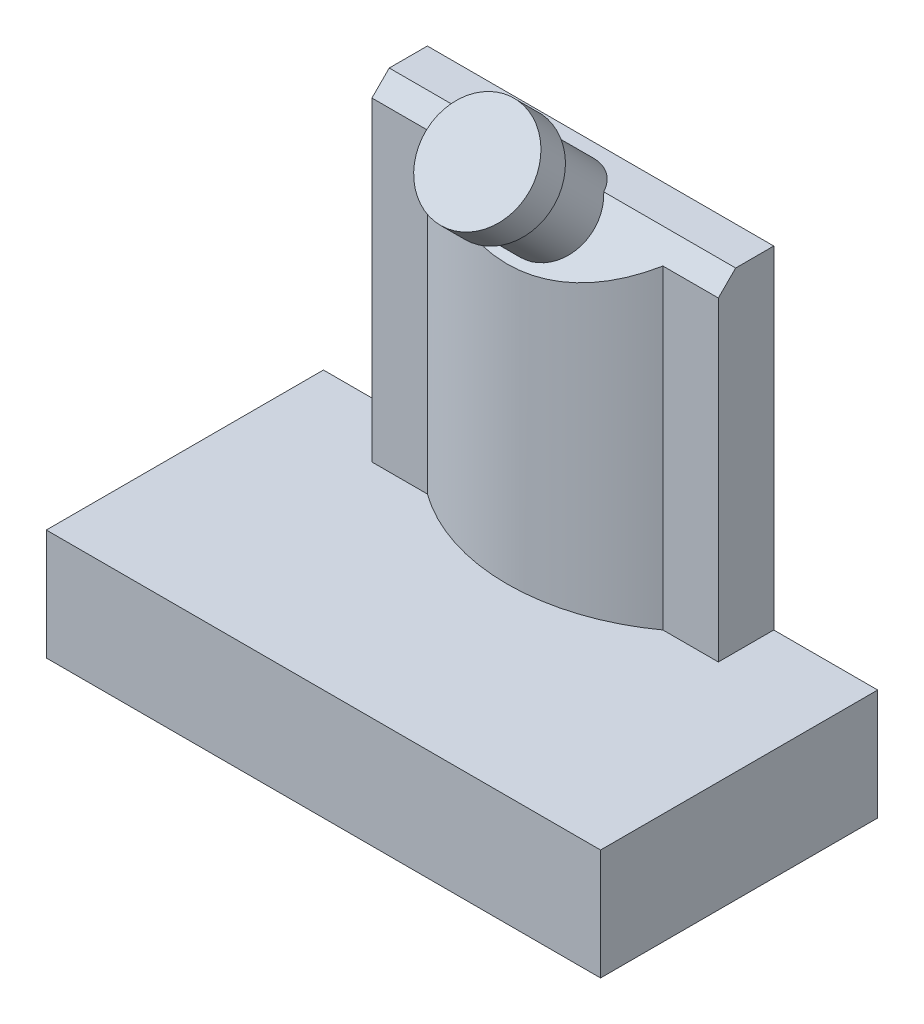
ISO-10303-21;
HEADER;
FILE_DESCRIPTION(('STEP AP214'),'2;1');
FILE_NAME('part.step','',(''),(''),'','','');
FILE_SCHEMA(('AUTOMOTIVE_DESIGN { 1 0 10303 214 1 1 1 1 }'));
ENDSEC;
DATA;
#1=APPLICATION_CONTEXT('core data for automotive mechanical design processes');
#2=APPLICATION_PROTOCOL_DEFINITION('international standard','automotive_design',2000,#1);
#3=PRODUCT_CONTEXT('',#1,'mechanical');
#4=PRODUCT('Part','Part','',(#3));
#5=PRODUCT_RELATED_PRODUCT_CATEGORY('part','',(#4));
#6=PRODUCT_DEFINITION_FORMATION('','',#4);
#7=PRODUCT_DEFINITION_CONTEXT('part definition',#1,'design');
#8=PRODUCT_DEFINITION('design','',#6,#7);
#9=PRODUCT_DEFINITION_SHAPE('','',#8);
#10=(LENGTH_UNIT() NAMED_UNIT(*) SI_UNIT(.MILLI.,.METRE.));
#11=(NAMED_UNIT(*) PLANE_ANGLE_UNIT() SI_UNIT($,.RADIAN.));
#12=(NAMED_UNIT(*) SI_UNIT($,.STERADIAN.) SOLID_ANGLE_UNIT());
#13=UNCERTAINTY_MEASURE_WITH_UNIT(LENGTH_MEASURE(1.E-05),#10,'distance_accuracy_value','');
#14=(GEOMETRIC_REPRESENTATION_CONTEXT(3) GLOBAL_UNCERTAINTY_ASSIGNED_CONTEXT((#13)) GLOBAL_UNIT_ASSIGNED_CONTEXT((#10,
#11,#12)) REPRESENTATION_CONTEXT('',''));
#15=CARTESIAN_POINT('',(0.,0.,0.));
#16=DIRECTION('',(0.,0.,1.));
#17=DIRECTION('',(1.,0.,0.));
#18=AXIS2_PLACEMENT_3D('',#15,#16,#17);
#19=CARTESIAN_POINT('',(8.2,-499982.257725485,-500000.883883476));
#20=DIRECTION('',(0.,0.707106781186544,0.707106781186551));
#21=DIRECTION('',(0.,-0.707106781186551,0.707106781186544));
#22=AXIS2_PLACEMENT_3D('',#19,#20,#21);
#23=CYLINDRICAL_SURFACE('',#22,1.24999999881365);
#24=CARTESIAN_POINT('',(8.2,12.800000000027,-5.82615798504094));
#25=DIRECTION('',(0.,1.,0.));
#26=DIRECTION('',(0.,0.,1.));
#27=AXIS2_PLACEMENT_3D('',#24,#25,#26);
#28=ELLIPSE('',#27,1.76776695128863,1.24999999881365);
#29=CARTESIAN_POINT('',(7.20705908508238,12.8,-6.90000000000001));
#30=VERTEX_POINT('',#29);
#31=CARTESIAN_POINT('',(9.19294091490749,12.8,-6.89999999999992));
#32=VERTEX_POINT('',#31);
#33=EDGE_CURVE('E42',#30,#32,#28,.F.);
#34=ORIENTED_EDGE('',*,*,#33,.F.);
#35=CARTESIAN_POINT('',(8.2,12.2630789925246,-6.36307899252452));
#36=DIRECTION('',(0.,0.707106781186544,0.707106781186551));
#37=DIRECTION('',(0.,-0.707106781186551,0.707106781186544));
#38=AXIS2_PLACEMENT_3D('',#35,#36,#37);
#39=CIRCLE('',#38,1.24999999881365);
#40=EDGE_CURVE('E138',#30,#32,#39,.T.);
#41=ORIENTED_EDGE('',*,*,#40,.T.);
#42=EDGE_LOOP('',(#34,#41));
#43=FACE_BOUND('',#42,.T.);
#44=CARTESIAN_POINT('',(8.2,13.6772925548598,-4.94886543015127));
#45=DIRECTION('',(0.,0.707106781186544,0.707106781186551));
#46=DIRECTION('',(0.,-0.707106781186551,0.707106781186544));
#47=AXIS2_PLACEMENT_3D('',#44,#45,#46);
#48=CIRCLE('',#47,1.24999999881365);
#49=CARTESIAN_POINT('',(8.2,12.7934090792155,-4.06498195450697));
#50=VERTEX_POINT('',#49);
#51=EDGE_CURVE('E30',#50,#50,#48,.F.);
#52=ORIENTED_EDGE('',*,*,#51,.T.);
#53=EDGE_LOOP('',(#52));
#54=FACE_BOUND('',#53,.T.);
#55=ADVANCED_FACE('F26',(#43,#54),#23,.T.);
#56=CARTESIAN_POINT('',(0.,3.2,-8.));
#57=DIRECTION('',(0.,-1.,0.));
#58=DIRECTION('',(0.,0.,-1.));
#59=AXIS2_PLACEMENT_3D('',#56,#57,#58);
#60=PLANE('',#59);
#61=DIRECTION('',(0.,0.,1.));
#62=VECTOR('',#61,1.);
#63=CARTESIAN_POINT('',(3.,3.2,-8.));
#64=LINE('',#63,#62);
#65=CARTESIAN_POINT('',(3.,3.2,-8.));
#66=VERTEX_POINT('',#65);
#67=CARTESIAN_POINT('',(3.,3.2,-6.4));
#68=VERTEX_POINT('',#67);
#69=EDGE_CURVE('E205',#66,#68,#64,.T.);
#70=ORIENTED_EDGE('',*,*,#69,.F.);
#71=DIRECTION('',(-1.,0.,0.));
#72=VECTOR('',#71,1.);
#73=CARTESIAN_POINT('',(0.,3.2,-8.));
#74=LINE('',#73,#72);
#75=CARTESIAN_POINT('',(0.,3.2,-8.));
#76=VERTEX_POINT('',#75);
#77=EDGE_CURVE('E250',#66,#76,#74,.T.);
#78=ORIENTED_EDGE('',*,*,#77,.T.);
#79=DIRECTION('',(0.,0.,1.));
#80=VECTOR('',#79,1.);
#81=CARTESIAN_POINT('',(0.,3.2,0.));
#82=LINE('',#81,#80);
#83=CARTESIAN_POINT('',(0.,3.2,0.));
#84=VERTEX_POINT('',#83);
#85=EDGE_CURVE('E355',#76,#84,#82,.T.);
#86=ORIENTED_EDGE('',*,*,#85,.T.);
#87=DIRECTION('',(1.,0.,0.));
#88=VECTOR('',#87,1.);
#89=CARTESIAN_POINT('',(0.,3.2,0.));
#90=LINE('',#89,#88);
#91=CARTESIAN_POINT('',(16.,3.2,0.));
#92=VERTEX_POINT('',#91);
#93=EDGE_CURVE('E357',#84,#92,#90,.T.);
#94=ORIENTED_EDGE('',*,*,#93,.T.);
#95=DIRECTION('',(0.,0.,-1.));
#96=VECTOR('',#95,1.);
#97=CARTESIAN_POINT('',(16.,3.2,0.));
#98=LINE('',#97,#96);
#99=CARTESIAN_POINT('',(16.,3.2,-8.));
#100=VERTEX_POINT('',#99);
#101=EDGE_CURVE('E255',#92,#100,#98,.T.);
#102=ORIENTED_EDGE('',*,*,#101,.T.);
#103=CARTESIAN_POINT('',(13.,3.2,-8.));
#104=VERTEX_POINT('',#103);
#105=EDGE_CURVE('E246',#100,#104,#74,.T.);
#106=ORIENTED_EDGE('',*,*,#105,.T.);
#107=DIRECTION('',(0.,0.,-1.));
#108=VECTOR('',#107,1.);
#109=CARTESIAN_POINT('',(13.,3.2,-8.));
#110=LINE('',#109,#108);
#111=CARTESIAN_POINT('',(13.,3.2,-6.4));
#112=VERTEX_POINT('',#111);
#113=EDGE_CURVE('E215',#112,#104,#110,.T.);
#114=ORIENTED_EDGE('',*,*,#113,.F.);
#115=DIRECTION('',(1.,0.,0.));
#116=VECTOR('',#115,1.);
#117=CARTESIAN_POINT('',(13.,3.2,-6.4));
#118=LINE('',#117,#116);
#119=CARTESIAN_POINT('',(11.4,3.2,-6.4));
#120=VERTEX_POINT('',#119);
#121=EDGE_CURVE('E212',#120,#112,#118,.T.);
#122=ORIENTED_EDGE('',*,*,#121,.F.);
#123=CARTESIAN_POINT('',(8.,3.2,-11.1045454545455));
#124=DIRECTION('',(0.,1.,0.));
#125=DIRECTION('',(0.,0.,1.));
#126=AXIS2_PLACEMENT_3D('',#123,#124,#125);
#127=CIRCLE('',#126,5.80454545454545);
#128=CARTESIAN_POINT('',(4.6,3.2,-6.4));
#129=VERTEX_POINT('',#128);
#130=EDGE_CURVE('E209',#129,#120,#127,.T.);
#131=ORIENTED_EDGE('',*,*,#130,.F.);
#132=DIRECTION('',(1.,0.,0.));
#133=VECTOR('',#132,1.);
#134=CARTESIAN_POINT('',(3.,3.2,-6.4));
#135=LINE('',#134,#133);
#136=EDGE_CURVE('E206',#68,#129,#135,.T.);
#137=ORIENTED_EDGE('',*,*,#136,.F.);
#138=EDGE_LOOP('',(#70,#78,#86,#94,#102,#106,#114,#122,#131,#137));
#139=FACE_BOUND('',#138,.T.);
#140=ADVANCED_FACE('F162',(#139),#60,.F.);
#141=CARTESIAN_POINT('',(1.6,2.1,-6.4));
#142=DIRECTION('',(0.,-1.,0.));
#143=DIRECTION('',(0.,0.,-1.));
#144=AXIS2_PLACEMENT_3D('',#141,#142,#143);
#145=PLANE('',#144);
#146=DIRECTION('',(0.,0.,-1.));
#147=VECTOR('',#146,1.);
#148=CARTESIAN_POINT('',(1.6,2.1,-1.6));
#149=LINE('',#148,#147);
#150=CARTESIAN_POINT('',(1.6,2.1,-1.6));
#151=VERTEX_POINT('',#150);
#152=CARTESIAN_POINT('',(1.6,2.1,-6.4));
#153=VERTEX_POINT('',#152);
#154=EDGE_CURVE('E304',#151,#153,#149,.T.);
#155=ORIENTED_EDGE('',*,*,#154,.T.);
#156=DIRECTION('',(1.,0.,0.));
#157=VECTOR('',#156,1.);
#158=CARTESIAN_POINT('',(1.6,2.1,-6.4));
#159=LINE('',#158,#157);
#160=CARTESIAN_POINT('',(14.4,2.1,-6.4));
#161=VERTEX_POINT('',#160);
#162=EDGE_CURVE('E330',#153,#161,#159,.T.);
#163=ORIENTED_EDGE('',*,*,#162,.T.);
#164=DIRECTION('',(0.,0.,1.));
#165=VECTOR('',#164,1.);
#166=CARTESIAN_POINT('',(14.4,2.1,-1.6));
#167=LINE('',#166,#165);
#168=CARTESIAN_POINT('',(14.4,2.1,-1.6));
#169=VERTEX_POINT('',#168);
#170=EDGE_CURVE('E332',#161,#169,#167,.T.);
#171=ORIENTED_EDGE('',*,*,#170,.T.);
#172=DIRECTION('',(-1.,0.,0.));
#173=VECTOR('',#172,1.);
#174=CARTESIAN_POINT('',(1.6,2.1,-1.6));
#175=LINE('',#174,#173);
#176=EDGE_CURVE('E335',#169,#151,#175,.T.);
#177=ORIENTED_EDGE('',*,*,#176,.T.);
#178=EDGE_LOOP('',(#155,#163,#171,#177));
#179=FACE_BOUND('',#178,.T.);
#180=CARTESIAN_POINT('',(8.2,2.1,-3.9));
#181=DIRECTION('',(0.,-1.,0.));
#182=DIRECTION('',(0.,0.,-1.));
#183=AXIS2_PLACEMENT_3D('',#180,#181,#182);
#184=CIRCLE('',#183,1.5);
#185=CARTESIAN_POINT('',(8.2,2.1,-5.4));
#186=VERTEX_POINT('',#185);
#187=EDGE_CURVE('E307',#186,#186,#184,.T.);
#188=ORIENTED_EDGE('',*,*,#187,.F.);
#189=EDGE_LOOP('',(#188));
#190=FACE_BOUND('',#189,.T.);
#191=ADVANCED_FACE('F166',(#179,#190),#145,.T.);
#192=CARTESIAN_POINT('',(0.,3.2,0.));
#193=DIRECTION('',(1.,0.,0.));
#194=DIRECTION('',(0.,0.,-1.));
#195=AXIS2_PLACEMENT_3D('',#192,#193,#194);
#196=PLANE('',#195);
#197=DIRECTION('',(0.,0.,1.));
#198=VECTOR('',#197,1.);
#199=CARTESIAN_POINT('',(0.,0.,0.));
#200=LINE('',#199,#198);
#201=CARTESIAN_POINT('',(0.,0.,-8.));
#202=VERTEX_POINT('',#201);
#203=CARTESIAN_POINT('',(0.,0.,0.));
#204=VERTEX_POINT('',#203);
#205=EDGE_CURVE('E340',#202,#204,#200,.T.);
#206=ORIENTED_EDGE('',*,*,#205,.T.);
#207=DIRECTION('',(0.,-1.,0.));
#208=VECTOR('',#207,1.);
#209=CARTESIAN_POINT('',(0.,3.2,0.));
#210=LINE('',#209,#208);
#211=EDGE_CURVE('E266',#84,#204,#210,.T.);
#212=ORIENTED_EDGE('',*,*,#211,.F.);
#213=ORIENTED_EDGE('',*,*,#85,.F.);
#214=DIRECTION('',(0.,-1.,0.));
#215=VECTOR('',#214,1.);
#216=CARTESIAN_POINT('',(0.,3.2,-8.));
#217=LINE('',#216,#215);
#218=EDGE_CURVE('E249',#76,#202,#217,.T.);
#219=ORIENTED_EDGE('',*,*,#218,.T.);
#220=EDGE_LOOP('',(#206,#212,#213,#219));
#221=FACE_BOUND('',#220,.T.);
#222=ADVANCED_FACE('F28',(#221),#196,.F.);
#223=CARTESIAN_POINT('',(0.,3.2,0.));
#224=DIRECTION('',(0.,0.,-1.));
#225=DIRECTION('',(-1.,0.,0.));
#226=AXIS2_PLACEMENT_3D('',#223,#224,#225);
#227=PLANE('',#226);
#228=DIRECTION('',(1.,0.,0.));
#229=VECTOR('',#228,1.);
#230=CARTESIAN_POINT('',(0.,0.,0.));
#231=LINE('',#230,#229);
#232=CARTESIAN_POINT('',(16.,0.,0.));
#233=VERTEX_POINT('',#232);
#234=EDGE_CURVE('E349',#204,#233,#231,.T.);
#235=ORIENTED_EDGE('',*,*,#234,.T.);
#236=DIRECTION('',(0.,-1.,0.));
#237=VECTOR('',#236,1.);
#238=CARTESIAN_POINT('',(16.,3.2,0.));
#239=LINE('',#238,#237);
#240=EDGE_CURVE('E263',#92,#233,#239,.T.);
#241=ORIENTED_EDGE('',*,*,#240,.F.);
#242=ORIENTED_EDGE('',*,*,#93,.F.);
#243=ORIENTED_EDGE('',*,*,#211,.T.);
#244=EDGE_LOOP('',(#235,#241,#242,#243));
#245=FACE_BOUND('',#244,.T.);
#246=ADVANCED_FACE('F297',(#245),#227,.F.);
#247=CARTESIAN_POINT('',(16.,3.2,0.));
#248=DIRECTION('',(-1.,0.,0.));
#249=DIRECTION('',(0.,0.,1.));
#250=AXIS2_PLACEMENT_3D('',#247,#248,#249);
#251=PLANE('',#250);
#252=DIRECTION('',(0.,0.,-1.));
#253=VECTOR('',#252,1.);
#254=CARTESIAN_POINT('',(16.,0.,0.));
#255=LINE('',#254,#253);
#256=CARTESIAN_POINT('',(16.,0.,-8.));
#257=VERTEX_POINT('',#256);
#258=EDGE_CURVE('E351',#233,#257,#255,.T.);
#259=ORIENTED_EDGE('',*,*,#258,.T.);
#260=DIRECTION('',(0.,-1.,0.));
#261=VECTOR('',#260,1.);
#262=CARTESIAN_POINT('',(16.,3.2,-8.));
#263=LINE('',#262,#261);
#264=EDGE_CURVE('E260',#100,#257,#263,.T.);
#265=ORIENTED_EDGE('',*,*,#264,.F.);
#266=ORIENTED_EDGE('',*,*,#101,.F.);
#267=ORIENTED_EDGE('',*,*,#240,.T.);
#268=EDGE_LOOP('',(#259,#265,#266,#267));
#269=FACE_BOUND('',#268,.T.);
#270=ADVANCED_FACE('F376',(#269),#251,.F.);
#271=CARTESIAN_POINT('',(0.,3.2,-8.));
#272=DIRECTION('',(0.,0.,1.));
#273=DIRECTION('',(1.,0.,0.));
#274=AXIS2_PLACEMENT_3D('',#271,#272,#273);
#275=PLANE('',#274);
#276=DIRECTION('',(-1.,0.,0.));
#277=VECTOR('',#276,1.);
#278=CARTESIAN_POINT('',(0.,0.,-8.));
#279=LINE('',#278,#277);
#280=EDGE_CURVE('E353',#257,#202,#279,.T.);
#281=ORIENTED_EDGE('',*,*,#280,.T.);
#282=ORIENTED_EDGE('',*,*,#218,.F.);
#283=ORIENTED_EDGE('',*,*,#77,.F.);
#284=DIRECTION('',(0.,-1.,0.));
#285=VECTOR('',#284,1.);
#286=CARTESIAN_POINT('',(3.,12.8,-8.));
#287=LINE('',#286,#285);
#288=CARTESIAN_POINT('',(3.,12.8,-8.));
#289=VERTEX_POINT('',#288);
#290=EDGE_CURVE('E230',#289,#66,#287,.T.);
#291=ORIENTED_EDGE('',*,*,#290,.F.);
#292=DIRECTION('',(-1.,0.,0.));
#293=VECTOR('',#292,1.);
#294=CARTESIAN_POINT('',(3.,12.8,-8.));
#295=LINE('',#294,#293);
#296=CARTESIAN_POINT('',(13.,12.8,-8.));
#297=VERTEX_POINT('',#296);
#298=EDGE_CURVE('E389',#297,#289,#295,.T.);
#299=ORIENTED_EDGE('',*,*,#298,.F.);
#300=DIRECTION('',(0.,-1.,0.));
#301=VECTOR('',#300,1.);
#302=CARTESIAN_POINT('',(13.,12.8,-8.));
#303=LINE('',#302,#301);
#304=EDGE_CURVE('E226',#297,#104,#303,.T.);
#305=ORIENTED_EDGE('',*,*,#304,.T.);
#306=ORIENTED_EDGE('',*,*,#105,.F.);
#307=ORIENTED_EDGE('',*,*,#264,.T.);
#308=EDGE_LOOP('',(#281,#282,#283,#291,#299,#305,#306,#307));
#309=FACE_BOUND('',#308,.T.);
#310=ADVANCED_FACE('F370',(#309),#275,.F.);
#311=CARTESIAN_POINT('',(0.,0.,-8.));
#312=DIRECTION('',(0.,-1.,0.));
#313=DIRECTION('',(0.,0.,-1.));
#314=AXIS2_PLACEMENT_3D('',#311,#312,#313);
#315=PLANE('',#314);
#316=DIRECTION('',(0.,0.,-1.));
#317=VECTOR('',#316,1.);
#318=CARTESIAN_POINT('',(1.6,0.,-1.6));
#319=LINE('',#318,#317);
#320=CARTESIAN_POINT('',(1.6,0.,-1.6));
#321=VERTEX_POINT('',#320);
#322=CARTESIAN_POINT('',(1.6,0.,-6.4));
#323=VERTEX_POINT('',#322);
#324=EDGE_CURVE('E313',#321,#323,#319,.T.);
#325=ORIENTED_EDGE('',*,*,#324,.F.);
#326=DIRECTION('',(-1.,0.,0.));
#327=VECTOR('',#326,1.);
#328=CARTESIAN_POINT('',(1.6,0.,-1.6));
#329=LINE('',#328,#327);
#330=CARTESIAN_POINT('',(14.4,0.,-1.6));
#331=VERTEX_POINT('',#330);
#332=EDGE_CURVE('E326',#331,#321,#329,.T.);
#333=ORIENTED_EDGE('',*,*,#332,.F.);
#334=DIRECTION('',(0.,0.,1.));
#335=VECTOR('',#334,1.);
#336=CARTESIAN_POINT('',(14.4,0.,-1.6));
#337=LINE('',#336,#335);
#338=CARTESIAN_POINT('',(14.4,0.,-6.4));
#339=VERTEX_POINT('',#338);
#340=EDGE_CURVE('E323',#339,#331,#337,.T.);
#341=ORIENTED_EDGE('',*,*,#340,.F.);
#342=DIRECTION('',(1.,0.,0.));
#343=VECTOR('',#342,1.);
#344=CARTESIAN_POINT('',(1.6,0.,-6.4));
#345=LINE('',#344,#343);
#346=EDGE_CURVE('E320',#323,#339,#345,.T.);
#347=ORIENTED_EDGE('',*,*,#346,.F.);
#348=EDGE_LOOP('',(#325,#333,#341,#347));
#349=FACE_BOUND('',#348,.T.);
#350=ORIENTED_EDGE('',*,*,#205,.F.);
#351=ORIENTED_EDGE('',*,*,#280,.F.);
#352=ORIENTED_EDGE('',*,*,#258,.F.);
#353=ORIENTED_EDGE('',*,*,#234,.F.);
#354=EDGE_LOOP('',(#350,#351,#352,#353));
#355=FACE_BOUND('',#354,.T.);
#356=ADVANCED_FACE('F448',(#349,#355),#315,.T.);
#357=CARTESIAN_POINT('',(1.6,2.1,-1.6));
#358=DIRECTION('',(-1.,0.,0.));
#359=DIRECTION('',(0.,0.,1.));
#360=AXIS2_PLACEMENT_3D('',#357,#358,#359);
#361=PLANE('',#360);
#362=ORIENTED_EDGE('',*,*,#324,.T.);
#363=DIRECTION('',(0.,-1.,0.));
#364=VECTOR('',#363,1.);
#365=CARTESIAN_POINT('',(1.6,2.1,-6.4));
#366=LINE('',#365,#364);
#367=EDGE_CURVE('E337',#153,#323,#366,.T.);
#368=ORIENTED_EDGE('',*,*,#367,.F.);
#369=ORIENTED_EDGE('',*,*,#154,.F.);
#370=DIRECTION('',(0.,-1.,0.));
#371=VECTOR('',#370,1.);
#372=CARTESIAN_POINT('',(1.6,2.1,-1.6));
#373=LINE('',#372,#371);
#374=EDGE_CURVE('E338',#151,#321,#373,.T.);
#375=ORIENTED_EDGE('',*,*,#374,.T.);
#376=EDGE_LOOP('',(#362,#368,#369,#375));
#377=FACE_BOUND('',#376,.T.);
#378=ADVANCED_FACE('F501',(#377),#361,.F.);
#379=CARTESIAN_POINT('',(1.6,2.1,-1.6));
#380=DIRECTION('',(0.,0.,1.));
#381=DIRECTION('',(1.,0.,0.));
#382=AXIS2_PLACEMENT_3D('',#379,#380,#381);
#383=PLANE('',#382);
#384=ORIENTED_EDGE('',*,*,#332,.T.);
#385=ORIENTED_EDGE('',*,*,#374,.F.);
#386=ORIENTED_EDGE('',*,*,#176,.F.);
#387=DIRECTION('',(0.,-1.,0.));
#388=VECTOR('',#387,1.);
#389=CARTESIAN_POINT('',(14.4,2.1,-1.6));
#390=LINE('',#389,#388);
#391=EDGE_CURVE('E341',#169,#331,#390,.T.);
#392=ORIENTED_EDGE('',*,*,#391,.T.);
#393=EDGE_LOOP('',(#384,#385,#386,#392));
#394=FACE_BOUND('',#393,.T.);
#395=ADVANCED_FACE('F509',(#394),#383,.F.);
#396=CARTESIAN_POINT('',(14.4,2.1,-1.6));
#397=DIRECTION('',(1.,0.,0.));
#398=DIRECTION('',(0.,0.,-1.));
#399=AXIS2_PLACEMENT_3D('',#396,#397,#398);
#400=PLANE('',#399);
#401=ORIENTED_EDGE('',*,*,#340,.T.);
#402=ORIENTED_EDGE('',*,*,#391,.F.);
#403=ORIENTED_EDGE('',*,*,#170,.F.);
#404=DIRECTION('',(0.,-1.,0.));
#405=VECTOR('',#404,1.);
#406=CARTESIAN_POINT('',(14.4,2.1,-6.4));
#407=LINE('',#406,#405);
#408=EDGE_CURVE('E343',#161,#339,#407,.T.);
#409=ORIENTED_EDGE('',*,*,#408,.T.);
#410=EDGE_LOOP('',(#401,#402,#403,#409));
#411=FACE_BOUND('',#410,.T.);
#412=ADVANCED_FACE('F517',(#411),#400,.F.);
#413=CARTESIAN_POINT('',(1.6,2.1,-6.4));
#414=DIRECTION('',(0.,0.,-1.));
#415=DIRECTION('',(-1.,0.,0.));
#416=AXIS2_PLACEMENT_3D('',#413,#414,#415);
#417=PLANE('',#416);
#418=ORIENTED_EDGE('',*,*,#346,.T.);
#419=ORIENTED_EDGE('',*,*,#408,.F.);
#420=ORIENTED_EDGE('',*,*,#162,.F.);
#421=ORIENTED_EDGE('',*,*,#367,.T.);
#422=EDGE_LOOP('',(#418,#419,#420,#421));
#423=FACE_BOUND('',#422,.T.);
#424=ADVANCED_FACE('F419',(#423),#417,.F.);
#425=CARTESIAN_POINT('',(8.2,0.1,-3.9));
#426=DIRECTION('',(0.,-1.,0.));
#427=DIRECTION('',(0.,0.,-1.));
#428=AXIS2_PLACEMENT_3D('',#425,#426,#427);
#429=PLANE('',#428);
#430=CARTESIAN_POINT('',(8.2,0.1,-3.9));
#431=DIRECTION('',(0.,-1.,0.));
#432=DIRECTION('',(0.,0.,-1.));
#433=AXIS2_PLACEMENT_3D('',#430,#431,#432);
#434=CIRCLE('',#433,0.900000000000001);
#435=CARTESIAN_POINT('',(8.2,0.1,-4.8));
#436=VERTEX_POINT('',#435);
#437=EDGE_CURVE('E235',#436,#436,#434,.F.);
#438=ORIENTED_EDGE('',*,*,#437,.T.);
#439=EDGE_LOOP('',(#438));
#440=FACE_BOUND('',#439,.T.);
#441=CARTESIAN_POINT('',(8.2,0.1,-3.9));
#442=DIRECTION('',(0.,-1.,0.));
#443=DIRECTION('',(0.,0.,-1.));
#444=AXIS2_PLACEMENT_3D('',#441,#442,#443);
#445=CIRCLE('',#444,1.5);
#446=CARTESIAN_POINT('',(8.2,0.1,-5.4));
#447=VERTEX_POINT('',#446);
#448=EDGE_CURVE('E309',#447,#447,#445,.T.);
#449=ORIENTED_EDGE('',*,*,#448,.T.);
#450=EDGE_LOOP('',(#449));
#451=FACE_BOUND('',#450,.T.);
#452=ADVANCED_FACE('F418',(#440,#451),#429,.T.);
#453=CARTESIAN_POINT('',(8.2,0.1,-3.9));
#454=DIRECTION('',(0.,1.,0.));
#455=DIRECTION('',(0.,0.,1.));
#456=AXIS2_PLACEMENT_3D('',#453,#454,#455);
#457=CYLINDRICAL_SURFACE('',#456,1.5);
#458=ORIENTED_EDGE('',*,*,#448,.F.);
#459=EDGE_LOOP('',(#458));
#460=FACE_BOUND('',#459,.T.);
#461=ORIENTED_EDGE('',*,*,#187,.T.);
#462=EDGE_LOOP('',(#461));
#463=FACE_BOUND('',#462,.T.);
#464=ADVANCED_FACE('F286',(#460,#463),#457,.T.);
#465=CARTESIAN_POINT('',(8.2,0.1,-3.9));
#466=DIRECTION('',(0.,1.,0.));
#467=DIRECTION('',(0.,0.,1.));
#468=AXIS2_PLACEMENT_3D('',#465,#466,#467);
#469=CYLINDRICAL_SURFACE('',#468,0.800000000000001);
#470=CARTESIAN_POINT('',(8.2,0.2,-3.9));
#471=DIRECTION('',(0.,-1.,0.));
#472=DIRECTION('',(0.,0.,-1.));
#473=AXIS2_PLACEMENT_3D('',#470,#471,#472);
#474=CIRCLE('',#473,0.800000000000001);
#475=CARTESIAN_POINT('',(8.2,0.2,-4.7));
#476=VERTEX_POINT('',#475);
#477=EDGE_CURVE('E237',#476,#476,#474,.T.);
#478=ORIENTED_EDGE('',*,*,#477,.T.);
#479=EDGE_LOOP('',(#478));
#480=FACE_BOUND('',#479,.T.);
#481=CARTESIAN_POINT('',(8.2,2.1,-3.9));
#482=DIRECTION('',(0.,-1.,0.));
#483=DIRECTION('',(0.,0.,-1.));
#484=AXIS2_PLACEMENT_3D('',#481,#482,#483);
#485=CIRCLE('',#484,0.800000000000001);
#486=CARTESIAN_POINT('',(8.2,2.1,-4.7));
#487=VERTEX_POINT('',#486);
#488=EDGE_CURVE('E242',#487,#487,#485,.F.);
#489=ORIENTED_EDGE('',*,*,#488,.T.);
#490=EDGE_LOOP('',(#489));
#491=FACE_BOUND('',#490,.T.);
#492=ADVANCED_FACE('F271',(#480,#491),#469,.F.);
#493=ORIENTED_EDGE('',*,*,#488,.F.);
#494=EDGE_LOOP('',(#493));
#495=FACE_BOUND('',#494,.T.);
#496=ADVANCED_FACE('F273',(#495),#145,.T.);
#497=CARTESIAN_POINT('',(8.2,0.2,-3.9));
#498=DIRECTION('',(0.,-1.,0.));
#499=DIRECTION('',(0.,0.,-1.));
#500=AXIS2_PLACEMENT_3D('',#497,#498,#499);
#501=TOROIDAL_SURFACE('',#500,0.900000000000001,0.1);
#502=ORIENTED_EDGE('',*,*,#437,.F.);
#503=EDGE_LOOP('',(#502));
#504=FACE_BOUND('',#503,.T.);
#505=ORIENTED_EDGE('',*,*,#477,.F.);
#506=EDGE_LOOP('',(#505));
#507=FACE_BOUND('',#506,.T.);
#508=ADVANCED_FACE('F275',(#504,#507),#501,.T.);
#509=CARTESIAN_POINT('',(3.,12.8,-8.));
#510=DIRECTION('',(1.,0.,0.));
#511=DIRECTION('',(0.,0.,-1.));
#512=AXIS2_PLACEMENT_3D('',#509,#510,#511);
#513=PLANE('',#512);
#514=DIRECTION('',(0.,-1.,0.));
#515=VECTOR('',#514,1.);
#516=CARTESIAN_POINT('',(3.,12.8,-6.4));
#517=LINE('',#516,#515);
#518=CARTESIAN_POINT('',(3.,12.3,-6.4));
#519=VERTEX_POINT('',#518);
#520=EDGE_CURVE('E310',#519,#68,#517,.T.);
#521=ORIENTED_EDGE('',*,*,#520,.F.);
#522=DIRECTION('',(0.,0.707106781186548,-0.707106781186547));
#523=VECTOR('',#522,1.);
#524=CARTESIAN_POINT('',(3.,13.35,-7.45000000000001));
#525=LINE('',#524,#523);
#526=CARTESIAN_POINT('',(3.,12.8,-6.90000000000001));
#527=VERTEX_POINT('',#526);
#528=EDGE_CURVE('E202',#519,#527,#525,.T.);
#529=ORIENTED_EDGE('',*,*,#528,.T.);
#530=DIRECTION('',(0.,0.,1.));
#531=VECTOR('',#530,1.);
#532=CARTESIAN_POINT('',(3.,12.8,-8.));
#533=LINE('',#532,#531);
#534=EDGE_CURVE('E218',#289,#527,#533,.T.);
#535=ORIENTED_EDGE('',*,*,#534,.F.);
#536=ORIENTED_EDGE('',*,*,#290,.T.);
#537=ORIENTED_EDGE('',*,*,#69,.T.);
#538=EDGE_LOOP('',(#521,#529,#535,#536,#537));
#539=FACE_BOUND('',#538,.T.);
#540=ADVANCED_FACE('F282',(#539),#513,.F.);
#541=CARTESIAN_POINT('',(3.,12.8,-6.4));
#542=DIRECTION('',(0.,0.,-1.));
#543=DIRECTION('',(-1.,0.,0.));
#544=AXIS2_PLACEMENT_3D('',#541,#542,#543);
#545=PLANE('',#544);
#546=DIRECTION('',(0.,-1.,0.));
#547=VECTOR('',#546,1.);
#548=CARTESIAN_POINT('',(4.6,12.8,-6.4));
#549=LINE('',#548,#547);
#550=CARTESIAN_POINT('',(4.6,12.3,-6.4));
#551=VERTEX_POINT('',#550);
#552=EDGE_CURVE('E315',#551,#129,#549,.T.);
#553=ORIENTED_EDGE('',*,*,#552,.F.);
#554=DIRECTION('',(-1.,0.,0.));
#555=VECTOR('',#554,1.);
#556=CARTESIAN_POINT('',(3.,12.3,-6.4));
#557=LINE('',#556,#555);
#558=EDGE_CURVE('E199',#551,#519,#557,.T.);
#559=ORIENTED_EDGE('',*,*,#558,.T.);
#560=ORIENTED_EDGE('',*,*,#520,.T.);
#561=ORIENTED_EDGE('',*,*,#136,.T.);
#562=EDGE_LOOP('',(#553,#559,#560,#561));
#563=FACE_BOUND('',#562,.T.);
#564=ADVANCED_FACE('F397',(#563),#545,.F.);
#565=CARTESIAN_POINT('',(8.,12.8,-11.1045454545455));
#566=DIRECTION('',(0.,-1.,0.));
#567=DIRECTION('',(0.,0.,-1.));
#568=AXIS2_PLACEMENT_3D('',#565,#566,#567);
#569=CYLINDRICAL_SURFACE('',#568,5.80454545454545);
#570=CARTESIAN_POINT('',(8.,17.0045454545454,-11.1045454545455));
#571=DIRECTION('',(0.,-0.707106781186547,-0.707106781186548));
#572=DIRECTION('',(0.,-0.707106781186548,0.707106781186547));
#573=AXIS2_PLACEMENT_3D('',#570,#571,#572);
#574=ELLIPSE('',#573,8.20886690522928,5.80454545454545);
#575=CARTESIAN_POINT('',(11.4,12.3,-6.4));
#576=VERTEX_POINT('',#575);
#577=EDGE_CURVE('E197',#576,#551,#574,.T.);
#578=ORIENTED_EDGE('',*,*,#577,.T.);
#579=ORIENTED_EDGE('',*,*,#552,.T.);
#580=ORIENTED_EDGE('',*,*,#130,.T.);
#581=DIRECTION('',(0.,-1.,0.));
#582=VECTOR('',#581,1.);
#583=CARTESIAN_POINT('',(11.4,12.8,-6.4));
#584=LINE('',#583,#582);
#585=EDGE_CURVE('E385',#576,#120,#584,.T.);
#586=ORIENTED_EDGE('',*,*,#585,.F.);
#587=EDGE_LOOP('',(#578,#579,#580,#586));
#588=FACE_BOUND('',#587,.T.);
#589=ADVANCED_FACE('F393',(#588),#569,.T.);
#590=CARTESIAN_POINT('',(13.,12.8,-6.4));
#591=DIRECTION('',(0.,0.,-1.));
#592=DIRECTION('',(-1.,0.,0.));
#593=AXIS2_PLACEMENT_3D('',#590,#591,#592);
#594=PLANE('',#593);
#595=DIRECTION('',(0.,-1.,0.));
#596=VECTOR('',#595,1.);
#597=CARTESIAN_POINT('',(13.,12.8,-6.4));
#598=LINE('',#597,#596);
#599=CARTESIAN_POINT('',(13.,12.3,-6.4));
#600=VERTEX_POINT('',#599);
#601=EDGE_CURVE('E229',#600,#112,#598,.T.);
#602=ORIENTED_EDGE('',*,*,#601,.F.);
#603=DIRECTION('',(-1.,0.,0.));
#604=VECTOR('',#603,1.);
#605=CARTESIAN_POINT('',(13.,12.3,-6.4));
#606=LINE('',#605,#604);
#607=EDGE_CURVE('E194',#600,#576,#606,.T.);
#608=ORIENTED_EDGE('',*,*,#607,.T.);
#609=ORIENTED_EDGE('',*,*,#585,.T.);
#610=ORIENTED_EDGE('',*,*,#121,.T.);
#611=EDGE_LOOP('',(#602,#608,#609,#610));
#612=FACE_BOUND('',#611,.T.);
#613=ADVANCED_FACE('F404',(#612),#594,.F.);
#614=CARTESIAN_POINT('',(13.,12.8,-8.));
#615=DIRECTION('',(-1.,0.,0.));
#616=DIRECTION('',(0.,0.,1.));
#617=AXIS2_PLACEMENT_3D('',#614,#615,#616);
#618=PLANE('',#617);
#619=DIRECTION('',(0.,0.,-1.));
#620=VECTOR('',#619,1.);
#621=CARTESIAN_POINT('',(13.,12.8,-8.));
#622=LINE('',#621,#620);
#623=CARTESIAN_POINT('',(13.,12.8,-6.90000000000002));
#624=VERTEX_POINT('',#623);
#625=EDGE_CURVE('E403',#624,#297,#622,.T.);
#626=ORIENTED_EDGE('',*,*,#625,.F.);
#627=DIRECTION('',(0.,0.707106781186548,-0.707106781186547));
#628=VECTOR('',#627,1.);
#629=CARTESIAN_POINT('',(13.,12.8,-6.90000000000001));
#630=LINE('',#629,#628);
#631=EDGE_CURVE('E49',#600,#624,#630,.T.);
#632=ORIENTED_EDGE('',*,*,#631,.F.);
#633=ORIENTED_EDGE('',*,*,#601,.T.);
#634=ORIENTED_EDGE('',*,*,#113,.T.);
#635=ORIENTED_EDGE('',*,*,#304,.F.);
#636=EDGE_LOOP('',(#626,#632,#633,#634,#635));
#637=FACE_BOUND('',#636,.T.);
#638=ADVANCED_FACE('F159',(#637),#618,.F.);
#639=CARTESIAN_POINT('',(8.,12.8,-11.1045454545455));
#640=DIRECTION('',(0.,1.,0.));
#641=DIRECTION('',(0.,0.,1.));
#642=AXIS2_PLACEMENT_3D('',#639,#640,#641);
#643=PLANE('',#642);
#644=ORIENTED_EDGE('',*,*,#33,.T.);
#645=DIRECTION('',(-1.,0.,0.));
#646=VECTOR('',#645,1.);
#647=CARTESIAN_POINT('',(8.,12.8,-6.90000000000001));
#648=LINE('',#647,#646);
#649=EDGE_CURVE('E11',#624,#32,#648,.T.);
#650=ORIENTED_EDGE('',*,*,#649,.F.);
#651=ORIENTED_EDGE('',*,*,#625,.T.);
#652=ORIENTED_EDGE('',*,*,#298,.T.);
#653=ORIENTED_EDGE('',*,*,#534,.T.);
#654=EDGE_CURVE('E35',#30,#527,#648,.T.);
#655=ORIENTED_EDGE('',*,*,#654,.F.);
#656=EDGE_LOOP('',(#644,#650,#651,#652,#653,#655));
#657=FACE_BOUND('',#656,.T.);
#658=ADVANCED_FACE('F143',(#657),#643,.T.);
#659=CARTESIAN_POINT('',(-2.50000000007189E-05,12.8,-6.90000000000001));
#660=DIRECTION('',(0.,-0.707106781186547,-0.707106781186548));
#661=DIRECTION('',(0.,0.707106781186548,-0.707106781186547));
#662=AXIS2_PLACEMENT_3D('',#659,#660,#661);
#663=PLANE('',#662);
#664=ORIENTED_EDGE('',*,*,#649,.T.);
#665=ORIENTED_EDGE('',*,*,#40,.F.);
#666=ORIENTED_EDGE('',*,*,#654,.T.);
#667=ORIENTED_EDGE('',*,*,#528,.F.);
#668=ORIENTED_EDGE('',*,*,#558,.F.);
#669=ORIENTED_EDGE('',*,*,#577,.F.);
#670=ORIENTED_EDGE('',*,*,#607,.F.);
#671=ORIENTED_EDGE('',*,*,#631,.T.);
#672=EDGE_LOOP('',(#664,#665,#666,#667,#668,#669,#670,#671));
#673=FACE_BOUND('',#672,.T.);
#674=ADVANCED_FACE('F147',(#673),#663,.F.);
#675=CARTESIAN_POINT('',(8.2,13.6772925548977,-4.94886543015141));
#676=DIRECTION('',(0.,0.707106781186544,0.707106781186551));
#677=DIRECTION('',(0.,-0.707106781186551,0.707106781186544));
#678=AXIS2_PLACEMENT_3D('',#675,#676,#677);
#679=CYLINDRICAL_SURFACE('',#678,1.49999999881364);
#680=CARTESIAN_POINT('',(8.2,13.6772925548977,-4.94886543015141));
#681=DIRECTION('',(0.,0.707106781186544,0.707106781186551));
#682=DIRECTION('',(0.,-0.707106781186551,0.707106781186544));
#683=AXIS2_PLACEMENT_3D('',#680,#681,#682);
#684=CIRCLE('',#683,1.49999999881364);
#685=CARTESIAN_POINT('',(8.2,12.6166323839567,-3.88820525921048));
#686=VERTEX_POINT('',#685);
#687=EDGE_CURVE('E183',#686,#686,#684,.T.);
#688=ORIENTED_EDGE('',*,*,#687,.T.);
#689=EDGE_LOOP('',(#688));
#690=FACE_BOUND('',#689,.T.);
#691=CARTESIAN_POINT('',(8.2,14.3843993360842,-4.24175864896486));
#692=DIRECTION('',(0.,0.707106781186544,0.707106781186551));
#693=DIRECTION('',(0.,-0.707106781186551,0.707106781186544));
#694=AXIS2_PLACEMENT_3D('',#691,#692,#693);
#695=CIRCLE('',#694,1.49999999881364);
#696=CARTESIAN_POINT('',(8.2,13.3237391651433,-3.18109847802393));
#697=VERTEX_POINT('',#696);
#698=EDGE_CURVE('E184',#697,#697,#695,.T.);
#699=ORIENTED_EDGE('',*,*,#698,.F.);
#700=EDGE_LOOP('',(#699));
#701=FACE_BOUND('',#700,.T.);
#702=ADVANCED_FACE('F149',(#690,#701),#679,.T.);
#703=CARTESIAN_POINT('',(8.2,13.6772925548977,-4.94886543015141));
#704=DIRECTION('',(0.,0.707106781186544,0.707106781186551));
#705=DIRECTION('',(0.,-0.707106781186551,0.707106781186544));
#706=AXIS2_PLACEMENT_3D('',#703,#704,#705);
#707=PLANE('',#706);
#708=ORIENTED_EDGE('',*,*,#51,.F.);
#709=EDGE_LOOP('',(#708));
#710=FACE_BOUND('',#709,.T.);
#711=ORIENTED_EDGE('',*,*,#687,.F.);
#712=EDGE_LOOP('',(#711));
#713=FACE_BOUND('',#712,.T.);
#714=ADVANCED_FACE('F156',(#710,#713),#707,.F.);
#715=CARTESIAN_POINT('',(8.2,14.3843993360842,-4.24175864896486));
#716=DIRECTION('',(0.,0.707106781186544,0.707106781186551));
#717=DIRECTION('',(0.,-0.707106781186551,0.707106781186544));
#718=AXIS2_PLACEMENT_3D('',#715,#716,#717);
#719=PLANE('',#718);
#720=ORIENTED_EDGE('',*,*,#698,.T.);
#721=EDGE_LOOP('',(#720));
#722=FACE_BOUND('',#721,.T.);
#723=ADVANCED_FACE('F170',(#722),#719,.T.);
#724=CLOSED_SHELL('',(#55,#140,#191,#222,#246,#270,#310,#356,#378,#395,#412,#424,#452,#464,#492,
#496,#508,#540,#564,#589,#613,#638,#658,#674,#702,#714,#723));
#725=MANIFOLD_SOLID_BREP('B2',#724);
#726=ADVANCED_BREP_SHAPE_REPRESENTATION('',(#18,#725),#14);
#727=SHAPE_DEFINITION_REPRESENTATION(#9,#726);
ENDSEC;
END-ISO-10303-21;
